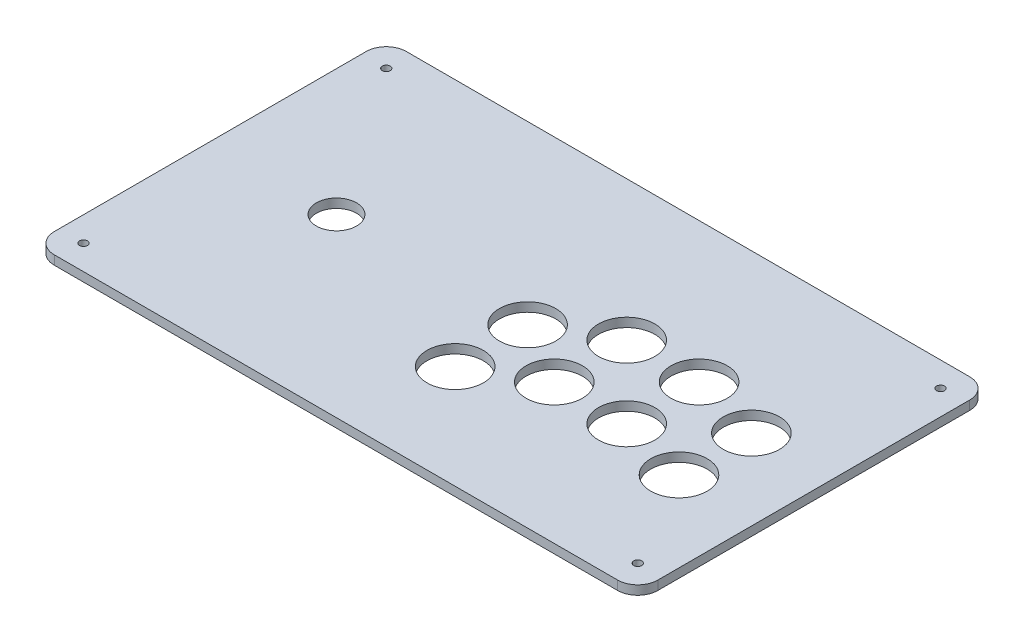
from build123d import *

# Parameters (mm, degrees)
SKETCH1_R           = 14
SKETCH1_R_2         = 10
BOSS_EXTRUDE1_DEPTH = 4.5
SKETCH3_R           = 2
CUT_EXTRUDE1_DEPTH  = 174.713845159


with BuildPart() as part:
    # Sketch1 → Boss-Extrude1 (new body)
    with BuildSketch(Plane(origin=(0, 0, 0), x_dir=(1, 0, 0), z_dir=(0, 1, 0))):
        with BuildLine():
            Line((140, -87.5), (-140, -87.5))
            ThreePointArc((-140, -87.5), (-147.071067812, -84.571067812), (-150, -77.5))
            Line((-150, -77.5), (-150, 77.5))
            ThreePointArc((-150, 77.5), (-147.071067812, 84.571067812), (-140, 87.5))
            Line((-140, 87.5), (140, 87.5))
            ThreePointArc((140, 87.5), (147.071067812, 84.571067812), (150, 77.5))
            Line((150, 77.5), (150, -77.5))
            ThreePointArc((150, -77.5), (147.071067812, -84.571067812), (140, -87.5))
        make_face()
        with Locations(Location((7.75, 0, 0), (0, 0, 270))):
            Circle(SKETCH1_R, mode=Mode.SUBTRACT)
        with Locations(Location((39, 18, 0), (0, 0, 270))):
            Circle(SKETCH1_R, mode=Mode.SUBTRACT)
        with Locations(Location((75, 18, 0), (0, 0, 270))):
            Circle(SKETCH1_R, mode=Mode.SUBTRACT)
        with Locations(Location((110, 9, 0), (0, 0, 270))):
            Circle(SKETCH1_R, mode=Mode.SUBTRACT)
        with Locations(Location((7.75, -36, 0), (0, 0, 270))):
            Circle(SKETCH1_R, mode=Mode.SUBTRACT)
        with Locations(Location((39, -18, 0), (0, 0, 270))):
            Circle(SKETCH1_R, mode=Mode.SUBTRACT)
        with Locations(Location((75, -18, 0), (0, 0, 270))):
            Circle(SKETCH1_R, mode=Mode.SUBTRACT)
        with Locations(Location((110, -27, 0), (0, 0, 270))):
            Circle(SKETCH1_R, mode=Mode.SUBTRACT)
        with Locations(Location((-87.25, 0, 0), (0, 0, 270))):
            Circle(SKETCH1_R_2, mode=Mode.SUBTRACT)
    extrude(amount=BOSS_EXTRUDE1_DEPTH)

    # Sketch3 → Cut-Extrude1 (cut, through all)
    with BuildSketch(Plane(origin=(0, 4.5, 0), x_dir=(1, 0, 0), z_dir=(0, 1, 0))):
        with Locations(Location((-137.75, 75.25, 0), (0, 0, 270))):
            Circle(SKETCH3_R)
        with Locations(Location((137.75, 75.25, 0), (0, 0, 270))):
            Circle(SKETCH3_R)
        with Locations(Location((137.75, -75.25, 0), (0, 0, 270))):
            Circle(SKETCH3_R)
        with Locations(Location((-137.75, -75.25, 0), (0, 0, 270))):
            Circle(SKETCH3_R)
    extrude(amount=-CUT_EXTRUDE1_DEPTH, mode=Mode.SUBTRACT)


solid = part.part
